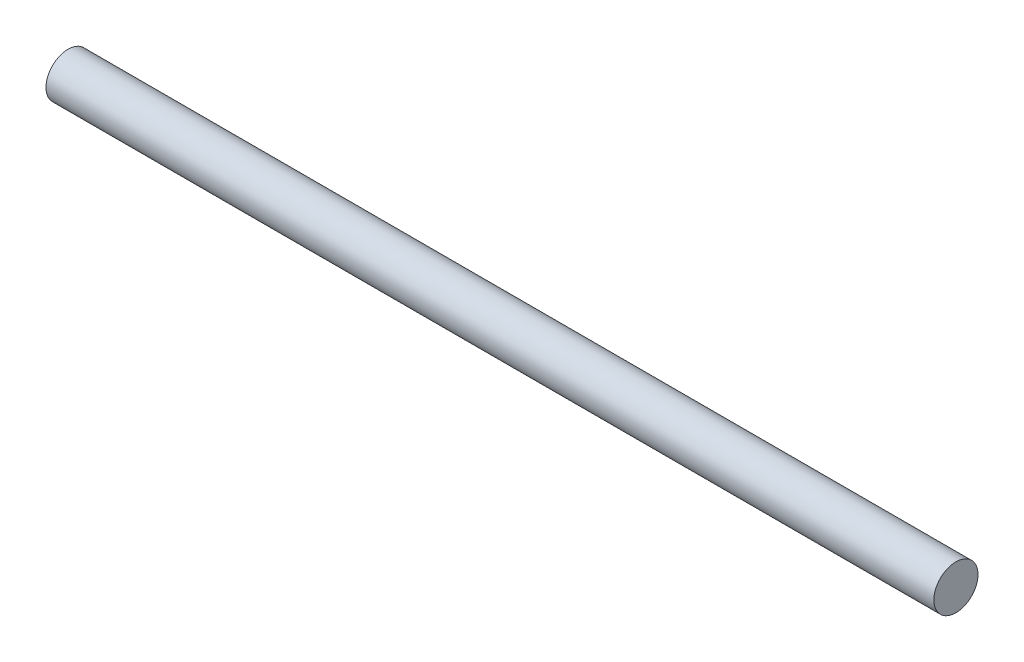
ISO-10303-21;
HEADER;
FILE_DESCRIPTION(('STEP AP214'),'2;1');
FILE_NAME('part.step','',(''),(''),'','','');
FILE_SCHEMA(('AUTOMOTIVE_DESIGN { 1 0 10303 214 1 1 1 1 }'));
ENDSEC;
DATA;
#1=APPLICATION_CONTEXT('core data for automotive mechanical design processes');
#2=APPLICATION_PROTOCOL_DEFINITION('international standard','automotive_design',2000,#1);
#3=PRODUCT_CONTEXT('',#1,'mechanical');
#4=PRODUCT('Part','Part','',(#3));
#5=PRODUCT_RELATED_PRODUCT_CATEGORY('part','',(#4));
#6=PRODUCT_DEFINITION_FORMATION('','',#4);
#7=PRODUCT_DEFINITION_CONTEXT('part definition',#1,'design');
#8=PRODUCT_DEFINITION('design','',#6,#7);
#9=PRODUCT_DEFINITION_SHAPE('','',#8);
#10=(LENGTH_UNIT() NAMED_UNIT(*) SI_UNIT(.MILLI.,.METRE.));
#11=(NAMED_UNIT(*) PLANE_ANGLE_UNIT() SI_UNIT($,.RADIAN.));
#12=(NAMED_UNIT(*) SI_UNIT($,.STERADIAN.) SOLID_ANGLE_UNIT());
#13=UNCERTAINTY_MEASURE_WITH_UNIT(LENGTH_MEASURE(1.E-05),#10,'distance_accuracy_value','');
#14=(GEOMETRIC_REPRESENTATION_CONTEXT(3) GLOBAL_UNCERTAINTY_ASSIGNED_CONTEXT((#13)) GLOBAL_UNIT_ASSIGNED_CONTEXT((#10,
#11,#12)) REPRESENTATION_CONTEXT('',''));
#15=CARTESIAN_POINT('',(0.,0.,0.));
#16=DIRECTION('',(0.,0.,1.));
#17=DIRECTION('',(1.,0.,0.));
#18=AXIS2_PLACEMENT_3D('',#15,#16,#17);
#19=CARTESIAN_POINT('',(-201.,0.,0.));
#20=DIRECTION('',(-1.,0.,0.));
#21=DIRECTION('',(0.,-1.,0.));
#22=AXIS2_PLACEMENT_3D('',#19,#20,#21);
#23=PLANE('',#22);
#24=CARTESIAN_POINT('',(-201.,0.,0.));
#25=DIRECTION('',(1.,0.,0.));
#26=DIRECTION('',(0.,1.,0.));
#27=AXIS2_PLACEMENT_3D('',#24,#25,#26);
#28=CIRCLE('',#27,5.);
#29=CARTESIAN_POINT('',(-201.,4.99999999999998,0.));
#30=VERTEX_POINT('',#29);
#31=EDGE_CURVE('E10',#30,#30,#28,.T.);
#32=ORIENTED_EDGE('',*,*,#31,.F.);
#33=EDGE_LOOP('',(#32));
#34=FACE_BOUND('',#33,.T.);
#35=ADVANCED_FACE('F35',(#34),#23,.T.);
#36=CARTESIAN_POINT('',(0.,0.,0.));
#37=DIRECTION('',(1.,0.,0.));
#38=DIRECTION('',(0.,1.,0.));
#39=AXIS2_PLACEMENT_3D('',#36,#37,#38);
#40=CYLINDRICAL_SURFACE('',#39,4.99999999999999);
#41=ORIENTED_EDGE('',*,*,#31,.T.);
#42=EDGE_LOOP('',(#41));
#43=FACE_BOUND('',#42,.T.);
#44=CARTESIAN_POINT('',(0.,0.,0.));
#45=DIRECTION('',(-1.,0.,0.));
#46=DIRECTION('',(0.,-1.,0.));
#47=AXIS2_PLACEMENT_3D('',#44,#45,#46);
#48=CIRCLE('',#47,4.99999999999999);
#49=CARTESIAN_POINT('',(0.,-4.99999999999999,0.));
#50=VERTEX_POINT('',#49);
#51=EDGE_CURVE('E41',#50,#50,#48,.F.);
#52=ORIENTED_EDGE('',*,*,#51,.F.);
#53=EDGE_LOOP('',(#52));
#54=FACE_BOUND('',#53,.T.);
#55=ADVANCED_FACE('F49',(#43,#54),#40,.T.);
#56=CARTESIAN_POINT('',(0.,0.,0.));
#57=DIRECTION('',(-1.,0.,0.));
#58=DIRECTION('',(0.,-1.,0.));
#59=AXIS2_PLACEMENT_3D('',#56,#57,#58);
#60=PLANE('',#59);
#61=ORIENTED_EDGE('',*,*,#51,.T.);
#62=EDGE_LOOP('',(#61));
#63=FACE_BOUND('',#62,.T.);
#64=ADVANCED_FACE('F47',(#63),#60,.F.);
#65=CLOSED_SHELL('',(#35,#55,#64));
#66=MANIFOLD_SOLID_BREP('B2',#65);
#67=ADVANCED_BREP_SHAPE_REPRESENTATION('',(#18,#66),#14);
#68=SHAPE_DEFINITION_REPRESENTATION(#9,#67);
ENDSEC;
END-ISO-10303-21;
